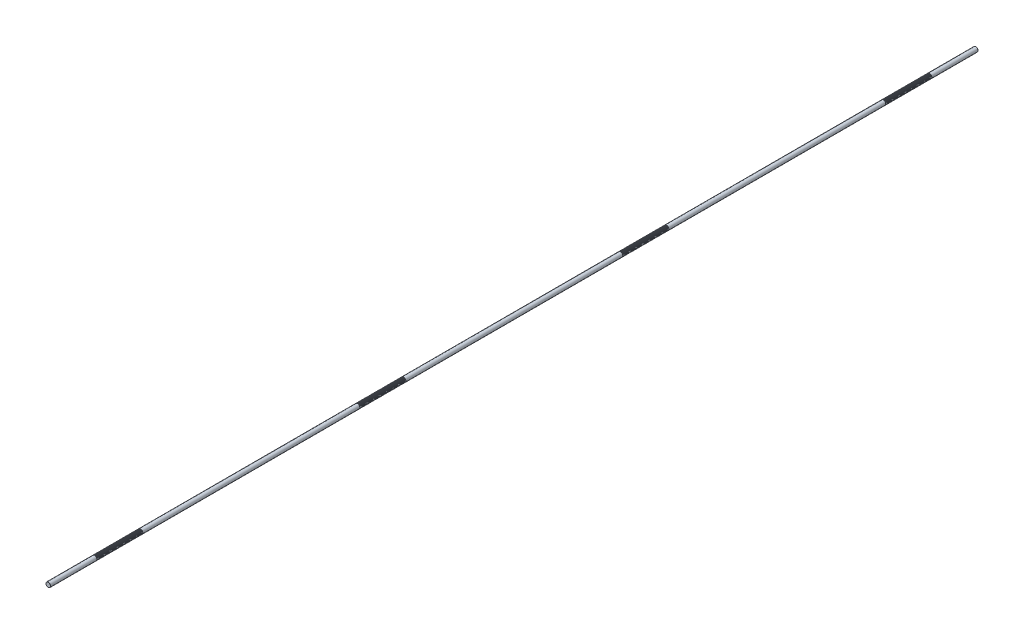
from build123d import *

# Parameters (mm, degrees)
SKETCH1_R           = 5
BOSS_EXTRUDE1_DEPTH = 1000
CHAMFER1_SIZE       = 0.25
LPATTERN1_COUNT     = 50
LPATTERN1_PITCH     = 2
LPATTERN2_COUNT     = 4
LPATTERN2_PITCH     = 567


with BuildPart() as part:
    # Sketch1 → Boss-Extrude1 (new, symmetric)
    with BuildSketch(Plane.XY):
        Circle(SKETCH1_R)
    extrude(amount=BOSS_EXTRUDE1_DEPTH, both=True)

    # Chamfer1
    chamfer1_edges = [part.edges().sort_by_distance(p)[0] for p in [
        (-5, 0, -1000),
        (-5, 0, 1000),
    ]]
    chamfer(chamfer1_edges, length=CHAMFER1_SIZE)

    # Sketch2 → Cut-Revolve1 (revolve, cut)
    with BuildSketch(Plane(origin=(0, 0, 0), x_dir=(0, 0, -1), z_dir=(1, 0, 0)), mode=Mode.PRIVATE) as cut_revolve1_sk:
        Polygon((900.167468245, 5), (898.832531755, 5), (899.167468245, 3.75), (899.832531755, 3.75), align=None)
    cut_revolve1 = revolve(cut_revolve1_sk.sketch.rotate(Axis((0, 0, 1000), (0, 0, -1)), 90), axis=Axis((0, 0, 1000), (0, 0, -1)), mode=Mode.SUBTRACT)

    # LPattern1: Cut-Revolve1 ×50
    with Locations(*[(0, 0, i * LPATTERN1_PITCH) for i in range(1, LPATTERN1_COUNT)]):
        add(cut_revolve1, mode=Mode.SUBTRACT)

    # LPattern2: Cut-Revolve1 ×4
    with Locations(*[(0, 0, i * LPATTERN2_PITCH) for i in range(1, LPATTERN2_COUNT)]):
        add(cut_revolve1, mode=Mode.SUBTRACT)

    # LPattern2 copy 1 sketch → LPattern2 copy 1 (revolve, cut)
    with BuildSketch(Plane(origin=(0, 0, 569), x_dir=(0, 0, -1), z_dir=(1, 0, 0))):
        Polygon((900.167468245, 5), (898.832531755, 5), (899.167468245, 3.75), (899.832531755, 3.75), align=None)
    revolve(axis=Axis((0, 0, 1569), (0, 0, -1)), mode=Mode.SUBTRACT)

    # LPattern2 copy 2 sketch → LPattern2 copy 2 (revolve, cut)
    with BuildSketch(Plane(origin=(0, 0, 1136), x_dir=(0, 0, -1), z_dir=(1, 0, 0))):
        Polygon((900.167468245, 5), (898.832531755, 5), (899.167468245, 3.75), (899.832531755, 3.75), align=None)
    revolve(axis=Axis((0, 0, 2136), (0, 0, -1)), mode=Mode.SUBTRACT)

    # LPattern2 copy 3 sketch → LPattern2 copy 3 (revolve, cut)
    with BuildSketch(Plane(origin=(0, 0, 1703), x_dir=(0, 0, -1), z_dir=(1, 0, 0))):
        Polygon((900.167468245, 5), (898.832531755, 5), (899.167468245, 3.75), (899.832531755, 3.75), align=None)
    revolve(axis=Axis((0, 0, 2703), (0, 0, -1)), mode=Mode.SUBTRACT)

    # LPattern2 copy 4 sketch → LPattern2 copy 4 (revolve, cut)
    with BuildSketch(Plane(origin=(0, 0, 571), x_dir=(0, 0, -1), z_dir=(1, 0, 0))):
        Polygon((900.167468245, 5), (898.832531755, 5), (899.167468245, 3.75), (899.832531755, 3.75), align=None)
    revolve(axis=Axis((0, 0, 1571), (0, 0, -1)), mode=Mode.SUBTRACT)

    # LPattern2 copy 5 sketch → LPattern2 copy 5 (revolve, cut)
    with BuildSketch(Plane(origin=(0, 0, 1138), x_dir=(0, 0, -1), z_dir=(1, 0, 0))):
        Polygon((900.167468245, 5), (898.832531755, 5), (899.167468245, 3.75), (899.832531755, 3.75), align=None)
    revolve(axis=Axis((0, 0, 2138), (0, 0, -1)), mode=Mode.SUBTRACT)

    # LPattern2 copy 6 sketch → LPattern2 copy 6 (revolve, cut)
    with BuildSketch(Plane(origin=(0, 0, 1705), x_dir=(0, 0, -1), z_dir=(1, 0, 0))):
        Polygon((900.167468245, 5), (898.832531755, 5), (899.167468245, 3.75), (899.832531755, 3.75), align=None)
    revolve(axis=Axis((0, 0, 2705), (0, 0, -1)), mode=Mode.SUBTRACT)

    # LPattern2 copy 7 sketch → LPattern2 copy 7 (revolve, cut)
    with BuildSketch(Plane(origin=(0, 0, 573), x_dir=(0, 0, -1), z_dir=(1, 0, 0))):
        Polygon((900.167468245, 5), (898.832531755, 5), (899.167468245, 3.75), (899.832531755, 3.75), align=None)
    revolve(axis=Axis((0, 0, 1573), (0, 0, -1)), mode=Mode.SUBTRACT)

    # LPattern2 copy 8 sketch → LPattern2 copy 8 (revolve, cut)
    with BuildSketch(Plane(origin=(0, 0, 1140), x_dir=(0, 0, -1), z_dir=(1, 0, 0))):
        Polygon((900.167468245, 5), (898.832531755, 5), (899.167468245, 3.75), (899.832531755, 3.75), align=None)
    revolve(axis=Axis((0, 0, 2140), (0, 0, -1)), mode=Mode.SUBTRACT)

    # LPattern2 copy 9 sketch → LPattern2 copy 9 (revolve, cut)
    with BuildSketch(Plane(origin=(0, 0, 1707), x_dir=(0, 0, -1), z_dir=(1, 0, 0))):
        Polygon((900.167468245, 5), (898.832531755, 5), (899.167468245, 3.75), (899.832531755, 3.75), align=None)
    revolve(axis=Axis((0, 0, 2707), (0, 0, -1)), mode=Mode.SUBTRACT)

    # LPattern2 copy 10 sketch → LPattern2 copy 10 (revolve, cut)
    with BuildSketch(Plane(origin=(0, 0, 575), x_dir=(0, 0, -1), z_dir=(1, 0, 0))):
        Polygon((900.167468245, 5), (898.832531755, 5), (899.167468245, 3.75), (899.832531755, 3.75), align=None)
    revolve(axis=Axis((0, 0, 1575), (0, 0, -1)), mode=Mode.SUBTRACT)

    # LPattern2 copy 11 sketch → LPattern2 copy 11 (revolve, cut)
    with BuildSketch(Plane(origin=(0, 0, 1142), x_dir=(0, 0, -1), z_dir=(1, 0, 0))):
        Polygon((900.167468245, 5), (898.832531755, 5), (899.167468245, 3.75), (899.832531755, 3.75), align=None)
    revolve(axis=Axis((0, 0, 2142), (0, 0, -1)), mode=Mode.SUBTRACT)

    # LPattern2 copy 12 sketch → LPattern2 copy 12 (revolve, cut)
    with BuildSketch(Plane(origin=(0, 0, 1709), x_dir=(0, 0, -1), z_dir=(1, 0, 0))):
        Polygon((900.167468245, 5), (898.832531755, 5), (899.167468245, 3.75), (899.832531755, 3.75), align=None)
    revolve(axis=Axis((0, 0, 2709), (0, 0, -1)), mode=Mode.SUBTRACT)

    # LPattern2 copy 13 sketch → LPattern2 copy 13 (revolve, cut)
    with BuildSketch(Plane(origin=(0, 0, 577), x_dir=(0, 0, -1), z_dir=(1, 0, 0))):
        Polygon((900.167468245, 5), (898.832531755, 5), (899.167468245, 3.75), (899.832531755, 3.75), align=None)
    revolve(axis=Axis((0, 0, 1577), (0, 0, -1)), mode=Mode.SUBTRACT)

    # LPattern2 copy 14 sketch → LPattern2 copy 14 (revolve, cut)
    with BuildSketch(Plane(origin=(0, 0, 1144), x_dir=(0, 0, -1), z_dir=(1, 0, 0))):
        Polygon((900.167468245, 5), (898.832531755, 5), (899.167468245, 3.75), (899.832531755, 3.75), align=None)
    revolve(axis=Axis((0, 0, 2144), (0, 0, -1)), mode=Mode.SUBTRACT)

    # LPattern2 copy 15 sketch → LPattern2 copy 15 (revolve, cut)
    with BuildSketch(Plane(origin=(0, 0, 1711), x_dir=(0, 0, -1), z_dir=(1, 0, 0))):
        Polygon((900.167468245, 5), (898.832531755, 5), (899.167468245, 3.75), (899.832531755, 3.75), align=None)
    revolve(axis=Axis((0, 0, 2711), (0, 0, -1)), mode=Mode.SUBTRACT)

    # LPattern2 copy 16 sketch → LPattern2 copy 16 (revolve, cut)
    with BuildSketch(Plane(origin=(0, 0, 579), x_dir=(0, 0, -1), z_dir=(1, 0, 0))):
        Polygon((900.167468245, 5), (898.832531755, 5), (899.167468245, 3.75), (899.832531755, 3.75), align=None)
    revolve(axis=Axis((0, 0, 1579), (0, 0, -1)), mode=Mode.SUBTRACT)

    # LPattern2 copy 17 sketch → LPattern2 copy 17 (revolve, cut)
    with BuildSketch(Plane(origin=(0, 0, 1146), x_dir=(0, 0, -1), z_dir=(1, 0, 0))):
        Polygon((900.167468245, 5), (898.832531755, 5), (899.167468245, 3.75), (899.832531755, 3.75), align=None)
    revolve(axis=Axis((0, 0, 2146), (0, 0, -1)), mode=Mode.SUBTRACT)

    # LPattern2 copy 18 sketch → LPattern2 copy 18 (revolve, cut)
    with BuildSketch(Plane(origin=(0, 0, 1713), x_dir=(0, 0, -1), z_dir=(1, 0, 0))):
        Polygon((900.167468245, 5), (898.832531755, 5), (899.167468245, 3.75), (899.832531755, 3.75), align=None)
    revolve(axis=Axis((0, 0, 2713), (0, 0, -1)), mode=Mode.SUBTRACT)

    # LPattern2 copy 19 sketch → LPattern2 copy 19 (revolve, cut)
    with BuildSketch(Plane(origin=(0, 0, 581), x_dir=(0, 0, -1), z_dir=(1, 0, 0))):
        Polygon((900.167468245, 5), (898.832531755, 5), (899.167468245, 3.75), (899.832531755, 3.75), align=None)
    revolve(axis=Axis((0, 0, 1581), (0, 0, -1)), mode=Mode.SUBTRACT)

    # LPattern2 copy 20 sketch → LPattern2 copy 20 (revolve, cut)
    with BuildSketch(Plane(origin=(0, 0, 1148), x_dir=(0, 0, -1), z_dir=(1, 0, 0))):
        Polygon((900.167468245, 5), (898.832531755, 5), (899.167468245, 3.75), (899.832531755, 3.75), align=None)
    revolve(axis=Axis((0, 0, 2148), (0, 0, -1)), mode=Mode.SUBTRACT)

    # LPattern2 copy 21 sketch → LPattern2 copy 21 (revolve, cut)
    with BuildSketch(Plane(origin=(0, 0, 1715), x_dir=(0, 0, -1), z_dir=(1, 0, 0))):
        Polygon((900.167468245, 5), (898.832531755, 5), (899.167468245, 3.75), (899.832531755, 3.75), align=None)
    revolve(axis=Axis((0, 0, 2715), (0, 0, -1)), mode=Mode.SUBTRACT)

    # LPattern2 copy 22 sketch → LPattern2 copy 22 (revolve, cut)
    with BuildSketch(Plane(origin=(0, 0, 583), x_dir=(0, 0, -1), z_dir=(1, 0, 0))):
        Polygon((900.167468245, 5), (898.832531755, 5), (899.167468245, 3.75), (899.832531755, 3.75), align=None)
    revolve(axis=Axis((0, 0, 1583), (0, 0, -1)), mode=Mode.SUBTRACT)

    # LPattern2 copy 23 sketch → LPattern2 copy 23 (revolve, cut)
    with BuildSketch(Plane(origin=(0, 0, 1150), x_dir=(0, 0, -1), z_dir=(1, 0, 0))):
        Polygon((900.167468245, 5), (898.832531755, 5), (899.167468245, 3.75), (899.832531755, 3.75), align=None)
    revolve(axis=Axis((0, 0, 2150), (0, 0, -1)), mode=Mode.SUBTRACT)

    # LPattern2 copy 24 sketch → LPattern2 copy 24 (revolve, cut)
    with BuildSketch(Plane(origin=(0, 0, 1717), x_dir=(0, 0, -1), z_dir=(1, 0, 0))):
        Polygon((900.167468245, 5), (898.832531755, 5), (899.167468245, 3.75), (899.832531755, 3.75), align=None)
    revolve(axis=Axis((0, 0, 2717), (0, 0, -1)), mode=Mode.SUBTRACT)

    # LPattern2 copy 25 sketch → LPattern2 copy 25 (revolve, cut)
    with BuildSketch(Plane(origin=(0, 0, 585), x_dir=(0, 0, -1), z_dir=(1, 0, 0))):
        Polygon((900.167468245, 5), (898.832531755, 5), (899.167468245, 3.75), (899.832531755, 3.75), align=None)
    revolve(axis=Axis((0, 0, 1585), (0, 0, -1)), mode=Mode.SUBTRACT)

    # LPattern2 copy 26 sketch → LPattern2 copy 26 (revolve, cut)
    with BuildSketch(Plane(origin=(0, 0, 1152), x_dir=(0, 0, -1), z_dir=(1, 0, 0))):
        Polygon((900.167468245, 5), (898.832531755, 5), (899.167468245, 3.75), (899.832531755, 3.75), align=None)
    revolve(axis=Axis((0, 0, 2152), (0, 0, -1)), mode=Mode.SUBTRACT)

    # LPattern2 copy 27 sketch → LPattern2 copy 27 (revolve, cut)
    with BuildSketch(Plane(origin=(0, 0, 1719), x_dir=(0, 0, -1), z_dir=(1, 0, 0))):
        Polygon((900.167468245, 5), (898.832531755, 5), (899.167468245, 3.75), (899.832531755, 3.75), align=None)
    revolve(axis=Axis((0, 0, 2719), (0, 0, -1)), mode=Mode.SUBTRACT)

    # LPattern2 copy 28 sketch → LPattern2 copy 28 (revolve, cut)
    with BuildSketch(Plane(origin=(0, 0, 587), x_dir=(0, 0, -1), z_dir=(1, 0, 0))):
        Polygon((900.167468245, 5), (898.832531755, 5), (899.167468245, 3.75), (899.832531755, 3.75), align=None)
    revolve(axis=Axis((0, 0, 1587), (0, 0, -1)), mode=Mode.SUBTRACT)

    # LPattern2 copy 29 sketch → LPattern2 copy 29 (revolve, cut)
    with BuildSketch(Plane(origin=(0, 0, 1154), x_dir=(0, 0, -1), z_dir=(1, 0, 0))):
        Polygon((900.167468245, 5), (898.832531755, 5), (899.167468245, 3.75), (899.832531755, 3.75), align=None)
    revolve(axis=Axis((0, 0, 2154), (0, 0, -1)), mode=Mode.SUBTRACT)

    # LPattern2 copy 30 sketch → LPattern2 copy 30 (revolve, cut)
    with BuildSketch(Plane(origin=(0, 0, 1721), x_dir=(0, 0, -1), z_dir=(1, 0, 0))):
        Polygon((900.167468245, 5), (898.832531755, 5), (899.167468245, 3.75), (899.832531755, 3.75), align=None)
    revolve(axis=Axis((0, 0, 2721), (0, 0, -1)), mode=Mode.SUBTRACT)

    # LPattern2 copy 31 sketch → LPattern2 copy 31 (revolve, cut)
    with BuildSketch(Plane(origin=(0, 0, 589), x_dir=(0, 0, -1), z_dir=(1, 0, 0))):
        Polygon((900.167468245, 5), (898.832531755, 5), (899.167468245, 3.75), (899.832531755, 3.75), align=None)
    revolve(axis=Axis((0, 0, 1589), (0, 0, -1)), mode=Mode.SUBTRACT)

    # LPattern2 copy 32 sketch → LPattern2 copy 32 (revolve, cut)
    with BuildSketch(Plane(origin=(0, 0, 1156), x_dir=(0, 0, -1), z_dir=(1, 0, 0))):
        Polygon((900.167468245, 5), (898.832531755, 5), (899.167468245, 3.75), (899.832531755, 3.75), align=None)
    revolve(axis=Axis((0, 0, 2156), (0, 0, -1)), mode=Mode.SUBTRACT)

    # LPattern2 copy 33 sketch → LPattern2 copy 33 (revolve, cut)
    with BuildSketch(Plane(origin=(0, 0, 1723), x_dir=(0, 0, -1), z_dir=(1, 0, 0))):
        Polygon((900.167468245, 5), (898.832531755, 5), (899.167468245, 3.75), (899.832531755, 3.75), align=None)
    revolve(axis=Axis((0, 0, 2723), (0, 0, -1)), mode=Mode.SUBTRACT)

    # LPattern2 copy 34 sketch → LPattern2 copy 34 (revolve, cut)
    with BuildSketch(Plane(origin=(0, 0, 591), x_dir=(0, 0, -1), z_dir=(1, 0, 0))):
        Polygon((900.167468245, 5), (898.832531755, 5), (899.167468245, 3.75), (899.832531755, 3.75), align=None)
    revolve(axis=Axis((0, 0, 1591), (0, 0, -1)), mode=Mode.SUBTRACT)

    # LPattern2 copy 35 sketch → LPattern2 copy 35 (revolve, cut)
    with BuildSketch(Plane(origin=(0, 0, 1158), x_dir=(0, 0, -1), z_dir=(1, 0, 0))):
        Polygon((900.167468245, 5), (898.832531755, 5), (899.167468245, 3.75), (899.832531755, 3.75), align=None)
    revolve(axis=Axis((0, 0, 2158), (0, 0, -1)), mode=Mode.SUBTRACT)

    # LPattern2 copy 36 sketch → LPattern2 copy 36 (revolve, cut)
    with BuildSketch(Plane(origin=(0, 0, 1725), x_dir=(0, 0, -1), z_dir=(1, 0, 0))):
        Polygon((900.167468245, 5), (898.832531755, 5), (899.167468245, 3.75), (899.832531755, 3.75), align=None)
    revolve(axis=Axis((0, 0, 2725), (0, 0, -1)), mode=Mode.SUBTRACT)

    # LPattern2 copy 37 sketch → LPattern2 copy 37 (revolve, cut)
    with BuildSketch(Plane(origin=(0, 0, 593), x_dir=(0, 0, -1), z_dir=(1, 0, 0))):
        Polygon((900.167468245, 5), (898.832531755, 5), (899.167468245, 3.75), (899.832531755, 3.75), align=None)
    revolve(axis=Axis((0, 0, 1593), (0, 0, -1)), mode=Mode.SUBTRACT)

    # LPattern2 copy 38 sketch → LPattern2 copy 38 (revolve, cut)
    with BuildSketch(Plane(origin=(0, 0, 1160), x_dir=(0, 0, -1), z_dir=(1, 0, 0))):
        Polygon((900.167468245, 5), (898.832531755, 5), (899.167468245, 3.75), (899.832531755, 3.75), align=None)
    revolve(axis=Axis((0, 0, 2160), (0, 0, -1)), mode=Mode.SUBTRACT)

    # LPattern2 copy 39 sketch → LPattern2 copy 39 (revolve, cut)
    with BuildSketch(Plane(origin=(0, 0, 1727), x_dir=(0, 0, -1), z_dir=(1, 0, 0))):
        Polygon((900.167468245, 5), (898.832531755, 5), (899.167468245, 3.75), (899.832531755, 3.75), align=None)
    revolve(axis=Axis((0, 0, 2727), (0, 0, -1)), mode=Mode.SUBTRACT)

    # LPattern2 copy 40 sketch → LPattern2 copy 40 (revolve, cut)
    with BuildSketch(Plane(origin=(0, 0, 595), x_dir=(0, 0, -1), z_dir=(1, 0, 0))):
        Polygon((900.167468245, 5), (898.832531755, 5), (899.167468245, 3.75), (899.832531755, 3.75), align=None)
    revolve(axis=Axis((0, 0, 1595), (0, 0, -1)), mode=Mode.SUBTRACT)

    # LPattern2 copy 41 sketch → LPattern2 copy 41 (revolve, cut)
    with BuildSketch(Plane(origin=(0, 0, 1162), x_dir=(0, 0, -1), z_dir=(1, 0, 0))):
        Polygon((900.167468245, 5), (898.832531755, 5), (899.167468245, 3.75), (899.832531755, 3.75), align=None)
    revolve(axis=Axis((0, 0, 2162), (0, 0, -1)), mode=Mode.SUBTRACT)

    # LPattern2 copy 42 sketch → LPattern2 copy 42 (revolve, cut)
    with BuildSketch(Plane(origin=(0, 0, 1729), x_dir=(0, 0, -1), z_dir=(1, 0, 0))):
        Polygon((900.167468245, 5), (898.832531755, 5), (899.167468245, 3.75), (899.832531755, 3.75), align=None)
    revolve(axis=Axis((0, 0, 2729), (0, 0, -1)), mode=Mode.SUBTRACT)

    # LPattern2 copy 43 sketch → LPattern2 copy 43 (revolve, cut)
    with BuildSketch(Plane(origin=(0, 0, 597), x_dir=(0, 0, -1), z_dir=(1, 0, 0))):
        Polygon((900.167468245, 5), (898.832531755, 5), (899.167468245, 3.75), (899.832531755, 3.75), align=None)
    revolve(axis=Axis((0, 0, 1597), (0, 0, -1)), mode=Mode.SUBTRACT)

    # LPattern2 copy 44 sketch → LPattern2 copy 44 (revolve, cut)
    with BuildSketch(Plane(origin=(0, 0, 1164), x_dir=(0, 0, -1), z_dir=(1, 0, 0))):
        Polygon((900.167468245, 5), (898.832531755, 5), (899.167468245, 3.75), (899.832531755, 3.75), align=None)
    revolve(axis=Axis((0, 0, 2164), (0, 0, -1)), mode=Mode.SUBTRACT)

    # LPattern2 copy 45 sketch → LPattern2 copy 45 (revolve, cut)
    with BuildSketch(Plane(origin=(0, 0, 1731), x_dir=(0, 0, -1), z_dir=(1, 0, 0))):
        Polygon((900.167468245, 5), (898.832531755, 5), (899.167468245, 3.75), (899.832531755, 3.75), align=None)
    revolve(axis=Axis((0, 0, 2731), (0, 0, -1)), mode=Mode.SUBTRACT)

    # LPattern2 copy 46 sketch → LPattern2 copy 46 (revolve, cut)
    with BuildSketch(Plane(origin=(0, 0, 599), x_dir=(0, 0, -1), z_dir=(1, 0, 0))):
        Polygon((900.167468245, 5), (898.832531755, 5), (899.167468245, 3.75), (899.832531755, 3.75), align=None)
    revolve(axis=Axis((0, 0, 1599), (0, 0, -1)), mode=Mode.SUBTRACT)

    # LPattern2 copy 47 sketch → LPattern2 copy 47 (revolve, cut)
    with BuildSketch(Plane(origin=(0, 0, 1166), x_dir=(0, 0, -1), z_dir=(1, 0, 0))):
        Polygon((900.167468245, 5), (898.832531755, 5), (899.167468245, 3.75), (899.832531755, 3.75), align=None)
    revolve(axis=Axis((0, 0, 2166), (0, 0, -1)), mode=Mode.SUBTRACT)

    # LPattern2 copy 48 sketch → LPattern2 copy 48 (revolve, cut)
    with BuildSketch(Plane(origin=(0, 0, 1733), x_dir=(0, 0, -1), z_dir=(1, 0, 0))):
        Polygon((900.167468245, 5), (898.832531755, 5), (899.167468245, 3.75), (899.832531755, 3.75), align=None)
    revolve(axis=Axis((0, 0, 2733), (0, 0, -1)), mode=Mode.SUBTRACT)

    # LPattern2 copy 49 sketch → LPattern2 copy 49 (revolve, cut)
    with BuildSketch(Plane(origin=(0, 0, 601), x_dir=(0, 0, -1), z_dir=(1, 0, 0))):
        Polygon((900.167468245, 5), (898.832531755, 5), (899.167468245, 3.75), (899.832531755, 3.75), align=None)
    revolve(axis=Axis((0, 0, 1601), (0, 0, -1)), mode=Mode.SUBTRACT)

    # LPattern2 copy 50 sketch → LPattern2 copy 50 (revolve, cut)
    with BuildSketch(Plane(origin=(0, 0, 1168), x_dir=(0, 0, -1), z_dir=(1, 0, 0))):
        Polygon((900.167468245, 5), (898.832531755, 5), (899.167468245, 3.75), (899.832531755, 3.75), align=None)
    revolve(axis=Axis((0, 0, 2168), (0, 0, -1)), mode=Mode.SUBTRACT)

    # LPattern2 copy 51 sketch → LPattern2 copy 51 (revolve, cut)
    with BuildSketch(Plane(origin=(0, 0, 1735), x_dir=(0, 0, -1), z_dir=(1, 0, 0))):
        Polygon((900.167468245, 5), (898.832531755, 5), (899.167468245, 3.75), (899.832531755, 3.75), align=None)
    revolve(axis=Axis((0, 0, 2735), (0, 0, -1)), mode=Mode.SUBTRACT)

    # LPattern2 copy 52 sketch → LPattern2 copy 52 (revolve, cut)
    with BuildSketch(Plane(origin=(0, 0, 603), x_dir=(0, 0, -1), z_dir=(1, 0, 0))):
        Polygon((900.167468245, 5), (898.832531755, 5), (899.167468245, 3.75), (899.832531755, 3.75), align=None)
    revolve(axis=Axis((0, 0, 1603), (0, 0, -1)), mode=Mode.SUBTRACT)

    # LPattern2 copy 53 sketch → LPattern2 copy 53 (revolve, cut)
    with BuildSketch(Plane(origin=(0, 0, 1170), x_dir=(0, 0, -1), z_dir=(1, 0, 0))):
        Polygon((900.167468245, 5), (898.832531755, 5), (899.167468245, 3.75), (899.832531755, 3.75), align=None)
    revolve(axis=Axis((0, 0, 2170), (0, 0, -1)), mode=Mode.SUBTRACT)

    # LPattern2 copy 54 sketch → LPattern2 copy 54 (revolve, cut)
    with BuildSketch(Plane(origin=(0, 0, 1737), x_dir=(0, 0, -1), z_dir=(1, 0, 0))):
        Polygon((900.167468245, 5), (898.832531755, 5), (899.167468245, 3.75), (899.832531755, 3.75), align=None)
    revolve(axis=Axis((0, 0, 2737), (0, 0, -1)), mode=Mode.SUBTRACT)

    # LPattern2 copy 55 sketch → LPattern2 copy 55 (revolve, cut)
    with BuildSketch(Plane(origin=(0, 0, 605), x_dir=(0, 0, -1), z_dir=(1, 0, 0))):
        Polygon((900.167468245, 5), (898.832531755, 5), (899.167468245, 3.75), (899.832531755, 3.75), align=None)
    revolve(axis=Axis((0, 0, 1605), (0, 0, -1)), mode=Mode.SUBTRACT)

    # LPattern2 copy 56 sketch → LPattern2 copy 56 (revolve, cut)
    with BuildSketch(Plane(origin=(0, 0, 1172), x_dir=(0, 0, -1), z_dir=(1, 0, 0))):
        Polygon((900.167468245, 5), (898.832531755, 5), (899.167468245, 3.75), (899.832531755, 3.75), align=None)
    revolve(axis=Axis((0, 0, 2172), (0, 0, -1)), mode=Mode.SUBTRACT)

    # LPattern2 copy 57 sketch → LPattern2 copy 57 (revolve, cut)
    with BuildSketch(Plane(origin=(0, 0, 1739), x_dir=(0, 0, -1), z_dir=(1, 0, 0))):
        Polygon((900.167468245, 5), (898.832531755, 5), (899.167468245, 3.75), (899.832531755, 3.75), align=None)
    revolve(axis=Axis((0, 0, 2739), (0, 0, -1)), mode=Mode.SUBTRACT)

    # LPattern2 copy 58 sketch → LPattern2 copy 58 (revolve, cut)
    with BuildSketch(Plane(origin=(0, 0, 607), x_dir=(0, 0, -1), z_dir=(1, 0, 0))):
        Polygon((900.167468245, 5), (898.832531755, 5), (899.167468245, 3.75), (899.832531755, 3.75), align=None)
    revolve(axis=Axis((0, 0, 1607), (0, 0, -1)), mode=Mode.SUBTRACT)

    # LPattern2 copy 59 sketch → LPattern2 copy 59 (revolve, cut)
    with BuildSketch(Plane(origin=(0, 0, 1174), x_dir=(0, 0, -1), z_dir=(1, 0, 0))):
        Polygon((900.167468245, 5), (898.832531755, 5), (899.167468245, 3.75), (899.832531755, 3.75), align=None)
    revolve(axis=Axis((0, 0, 2174), (0, 0, -1)), mode=Mode.SUBTRACT)

    # LPattern2 copy 60 sketch → LPattern2 copy 60 (revolve, cut)
    with BuildSketch(Plane(origin=(0, 0, 1741), x_dir=(0, 0, -1), z_dir=(1, 0, 0))):
        Polygon((900.167468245, 5), (898.832531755, 5), (899.167468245, 3.75), (899.832531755, 3.75), align=None)
    revolve(axis=Axis((0, 0, 2741), (0, 0, -1)), mode=Mode.SUBTRACT)

    # LPattern2 copy 61 sketch → LPattern2 copy 61 (revolve, cut)
    with BuildSketch(Plane(origin=(0, 0, 609), x_dir=(0, 0, -1), z_dir=(1, 0, 0))):
        Polygon((900.167468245, 5), (898.832531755, 5), (899.167468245, 3.75), (899.832531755, 3.75), align=None)
    revolve(axis=Axis((0, 0, 1609), (0, 0, -1)), mode=Mode.SUBTRACT)

    # LPattern2 copy 62 sketch → LPattern2 copy 62 (revolve, cut)
    with BuildSketch(Plane(origin=(0, 0, 1176), x_dir=(0, 0, -1), z_dir=(1, 0, 0))):
        Polygon((900.167468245, 5), (898.832531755, 5), (899.167468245, 3.75), (899.832531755, 3.75), align=None)
    revolve(axis=Axis((0, 0, 2176), (0, 0, -1)), mode=Mode.SUBTRACT)

    # LPattern2 copy 63 sketch → LPattern2 copy 63 (revolve, cut)
    with BuildSketch(Plane(origin=(0, 0, 1743), x_dir=(0, 0, -1), z_dir=(1, 0, 0))):
        Polygon((900.167468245, 5), (898.832531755, 5), (899.167468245, 3.75), (899.832531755, 3.75), align=None)
    revolve(axis=Axis((0, 0, 2743), (0, 0, -1)), mode=Mode.SUBTRACT)

    # LPattern2 copy 64 sketch → LPattern2 copy 64 (revolve, cut)
    with BuildSketch(Plane(origin=(0, 0, 611), x_dir=(0, 0, -1), z_dir=(1, 0, 0))):
        Polygon((900.167468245, 5), (898.832531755, 5), (899.167468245, 3.75), (899.832531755, 3.75), align=None)
    revolve(axis=Axis((0, 0, 1611), (0, 0, -1)), mode=Mode.SUBTRACT)

    # LPattern2 copy 65 sketch → LPattern2 copy 65 (revolve, cut)
    with BuildSketch(Plane(origin=(0, 0, 1178), x_dir=(0, 0, -1), z_dir=(1, 0, 0))):
        Polygon((900.167468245, 5), (898.832531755, 5), (899.167468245, 3.75), (899.832531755, 3.75), align=None)
    revolve(axis=Axis((0, 0, 2178), (0, 0, -1)), mode=Mode.SUBTRACT)

    # LPattern2 copy 66 sketch → LPattern2 copy 66 (revolve, cut)
    with BuildSketch(Plane(origin=(0, 0, 1745), x_dir=(0, 0, -1), z_dir=(1, 0, 0))):
        Polygon((900.167468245, 5), (898.832531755, 5), (899.167468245, 3.75), (899.832531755, 3.75), align=None)
    revolve(axis=Axis((0, 0, 2745), (0, 0, -1)), mode=Mode.SUBTRACT)

    # LPattern2 copy 67 sketch → LPattern2 copy 67 (revolve, cut)
    with BuildSketch(Plane(origin=(0, 0, 613), x_dir=(0, 0, -1), z_dir=(1, 0, 0))):
        Polygon((900.167468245, 5), (898.832531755, 5), (899.167468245, 3.75), (899.832531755, 3.75), align=None)
    revolve(axis=Axis((0, 0, 1613), (0, 0, -1)), mode=Mode.SUBTRACT)

    # LPattern2 copy 68 sketch → LPattern2 copy 68 (revolve, cut)
    with BuildSketch(Plane(origin=(0, 0, 1180), x_dir=(0, 0, -1), z_dir=(1, 0, 0))):
        Polygon((900.167468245, 5), (898.832531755, 5), (899.167468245, 3.75), (899.832531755, 3.75), align=None)
    revolve(axis=Axis((0, 0, 2180), (0, 0, -1)), mode=Mode.SUBTRACT)

    # LPattern2 copy 69 sketch → LPattern2 copy 69 (revolve, cut)
    with BuildSketch(Plane(origin=(0, 0, 1747), x_dir=(0, 0, -1), z_dir=(1, 0, 0))):
        Polygon((900.167468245, 5), (898.832531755, 5), (899.167468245, 3.75), (899.832531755, 3.75), align=None)
    revolve(axis=Axis((0, 0, 2747), (0, 0, -1)), mode=Mode.SUBTRACT)

    # LPattern2 copy 70 sketch → LPattern2 copy 70 (revolve, cut)
    with BuildSketch(Plane(origin=(0, 0, 615), x_dir=(0, 0, -1), z_dir=(1, 0, 0))):
        Polygon((900.167468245, 5), (898.832531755, 5), (899.167468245, 3.75), (899.832531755, 3.75), align=None)
    revolve(axis=Axis((0, 0, 1615), (0, 0, -1)), mode=Mode.SUBTRACT)

    # LPattern2 copy 71 sketch → LPattern2 copy 71 (revolve, cut)
    with BuildSketch(Plane(origin=(0, 0, 1182), x_dir=(0, 0, -1), z_dir=(1, 0, 0))):
        Polygon((900.167468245, 5), (898.832531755, 5), (899.167468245, 3.75), (899.832531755, 3.75), align=None)
    revolve(axis=Axis((0, 0, 2182), (0, 0, -1)), mode=Mode.SUBTRACT)

    # LPattern2 copy 72 sketch → LPattern2 copy 72 (revolve, cut)
    with BuildSketch(Plane(origin=(0, 0, 1749), x_dir=(0, 0, -1), z_dir=(1, 0, 0))):
        Polygon((900.167468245, 5), (898.832531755, 5), (899.167468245, 3.75), (899.832531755, 3.75), align=None)
    revolve(axis=Axis((0, 0, 2749), (0, 0, -1)), mode=Mode.SUBTRACT)

    # LPattern2 copy 73 sketch → LPattern2 copy 73 (revolve, cut)
    with BuildSketch(Plane(origin=(0, 0, 617), x_dir=(0, 0, -1), z_dir=(1, 0, 0))):
        Polygon((900.167468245, 5), (898.832531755, 5), (899.167468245, 3.75), (899.832531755, 3.75), align=None)
    revolve(axis=Axis((0, 0, 1617), (0, 0, -1)), mode=Mode.SUBTRACT)

    # LPattern2 copy 74 sketch → LPattern2 copy 74 (revolve, cut)
    with BuildSketch(Plane(origin=(0, 0, 1184), x_dir=(0, 0, -1), z_dir=(1, 0, 0))):
        Polygon((900.167468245, 5), (898.832531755, 5), (899.167468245, 3.75), (899.832531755, 3.75), align=None)
    revolve(axis=Axis((0, 0, 2184), (0, 0, -1)), mode=Mode.SUBTRACT)

    # LPattern2 copy 75 sketch → LPattern2 copy 75 (revolve, cut)
    with BuildSketch(Plane(origin=(0, 0, 1751), x_dir=(0, 0, -1), z_dir=(1, 0, 0))):
        Polygon((900.167468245, 5), (898.832531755, 5), (899.167468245, 3.75), (899.832531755, 3.75), align=None)
    revolve(axis=Axis((0, 0, 2751), (0, 0, -1)), mode=Mode.SUBTRACT)

    # LPattern2 copy 76 sketch → LPattern2 copy 76 (revolve, cut)
    with BuildSketch(Plane(origin=(0, 0, 619), x_dir=(0, 0, -1), z_dir=(1, 0, 0))):
        Polygon((900.167468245, 5), (898.832531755, 5), (899.167468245, 3.75), (899.832531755, 3.75), align=None)
    revolve(axis=Axis((0, 0, 1619), (0, 0, -1)), mode=Mode.SUBTRACT)

    # LPattern2 copy 77 sketch → LPattern2 copy 77 (revolve, cut)
    with BuildSketch(Plane(origin=(0, 0, 1186), x_dir=(0, 0, -1), z_dir=(1, 0, 0))):
        Polygon((900.167468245, 5), (898.832531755, 5), (899.167468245, 3.75), (899.832531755, 3.75), align=None)
    revolve(axis=Axis((0, 0, 2186), (0, 0, -1)), mode=Mode.SUBTRACT)

    # LPattern2 copy 78 sketch → LPattern2 copy 78 (revolve, cut)
    with BuildSketch(Plane(origin=(0, 0, 1753), x_dir=(0, 0, -1), z_dir=(1, 0, 0))):
        Polygon((900.167468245, 5), (898.832531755, 5), (899.167468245, 3.75), (899.832531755, 3.75), align=None)
    revolve(axis=Axis((0, 0, 2753), (0, 0, -1)), mode=Mode.SUBTRACT)

    # LPattern2 copy 79 sketch → LPattern2 copy 79 (revolve, cut)
    with BuildSketch(Plane(origin=(0, 0, 621), x_dir=(0, 0, -1), z_dir=(1, 0, 0))):
        Polygon((900.167468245, 5), (898.832531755, 5), (899.167468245, 3.75), (899.832531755, 3.75), align=None)
    revolve(axis=Axis((0, 0, 1621), (0, 0, -1)), mode=Mode.SUBTRACT)

    # LPattern2 copy 80 sketch → LPattern2 copy 80 (revolve, cut)
    with BuildSketch(Plane(origin=(0, 0, 1188), x_dir=(0, 0, -1), z_dir=(1, 0, 0))):
        Polygon((900.167468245, 5), (898.832531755, 5), (899.167468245, 3.75), (899.832531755, 3.75), align=None)
    revolve(axis=Axis((0, 0, 2188), (0, 0, -1)), mode=Mode.SUBTRACT)

    # LPattern2 copy 81 sketch → LPattern2 copy 81 (revolve, cut)
    with BuildSketch(Plane(origin=(0, 0, 1755), x_dir=(0, 0, -1), z_dir=(1, 0, 0))):
        Polygon((900.167468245, 5), (898.832531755, 5), (899.167468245, 3.75), (899.832531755, 3.75), align=None)
    revolve(axis=Axis((0, 0, 2755), (0, 0, -1)), mode=Mode.SUBTRACT)

    # LPattern2 copy 82 sketch → LPattern2 copy 82 (revolve, cut)
    with BuildSketch(Plane(origin=(0, 0, 623), x_dir=(0, 0, -1), z_dir=(1, 0, 0))):
        Polygon((900.167468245, 5), (898.832531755, 5), (899.167468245, 3.75), (899.832531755, 3.75), align=None)
    revolve(axis=Axis((0, 0, 1623), (0, 0, -1)), mode=Mode.SUBTRACT)

    # LPattern2 copy 83 sketch → LPattern2 copy 83 (revolve, cut)
    with BuildSketch(Plane(origin=(0, 0, 1190), x_dir=(0, 0, -1), z_dir=(1, 0, 0))):
        Polygon((900.167468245, 5), (898.832531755, 5), (899.167468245, 3.75), (899.832531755, 3.75), align=None)
    revolve(axis=Axis((0, 0, 2190), (0, 0, -1)), mode=Mode.SUBTRACT)

    # LPattern2 copy 84 sketch → LPattern2 copy 84 (revolve, cut)
    with BuildSketch(Plane(origin=(0, 0, 1757), x_dir=(0, 0, -1), z_dir=(1, 0, 0))):
        Polygon((900.167468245, 5), (898.832531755, 5), (899.167468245, 3.75), (899.832531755, 3.75), align=None)
    revolve(axis=Axis((0, 0, 2757), (0, 0, -1)), mode=Mode.SUBTRACT)

    # LPattern2 copy 85 sketch → LPattern2 copy 85 (revolve, cut)
    with BuildSketch(Plane(origin=(0, 0, 625), x_dir=(0, 0, -1), z_dir=(1, 0, 0))):
        Polygon((900.167468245, 5), (898.832531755, 5), (899.167468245, 3.75), (899.832531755, 3.75), align=None)
    revolve(axis=Axis((0, 0, 1625), (0, 0, -1)), mode=Mode.SUBTRACT)

    # LPattern2 copy 86 sketch → LPattern2 copy 86 (revolve, cut)
    with BuildSketch(Plane(origin=(0, 0, 1192), x_dir=(0, 0, -1), z_dir=(1, 0, 0))):
        Polygon((900.167468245, 5), (898.832531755, 5), (899.167468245, 3.75), (899.832531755, 3.75), align=None)
    revolve(axis=Axis((0, 0, 2192), (0, 0, -1)), mode=Mode.SUBTRACT)

    # LPattern2 copy 87 sketch → LPattern2 copy 87 (revolve, cut)
    with BuildSketch(Plane(origin=(0, 0, 1759), x_dir=(0, 0, -1), z_dir=(1, 0, 0))):
        Polygon((900.167468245, 5), (898.832531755, 5), (899.167468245, 3.75), (899.832531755, 3.75), align=None)
    revolve(axis=Axis((0, 0, 2759), (0, 0, -1)), mode=Mode.SUBTRACT)

    # LPattern2 copy 88 sketch → LPattern2 copy 88 (revolve, cut)
    with BuildSketch(Plane(origin=(0, 0, 627), x_dir=(0, 0, -1), z_dir=(1, 0, 0))):
        Polygon((900.167468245, 5), (898.832531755, 5), (899.167468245, 3.75), (899.832531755, 3.75), align=None)
    revolve(axis=Axis((0, 0, 1627), (0, 0, -1)), mode=Mode.SUBTRACT)

    # LPattern2 copy 89 sketch → LPattern2 copy 89 (revolve, cut)
    with BuildSketch(Plane(origin=(0, 0, 1194), x_dir=(0, 0, -1), z_dir=(1, 0, 0))):
        Polygon((900.167468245, 5), (898.832531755, 5), (899.167468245, 3.75), (899.832531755, 3.75), align=None)
    revolve(axis=Axis((0, 0, 2194), (0, 0, -1)), mode=Mode.SUBTRACT)

    # LPattern2 copy 90 sketch → LPattern2 copy 90 (revolve, cut)
    with BuildSketch(Plane(origin=(0, 0, 1761), x_dir=(0, 0, -1), z_dir=(1, 0, 0))):
        Polygon((900.167468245, 5), (898.832531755, 5), (899.167468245, 3.75), (899.832531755, 3.75), align=None)
    revolve(axis=Axis((0, 0, 2761), (0, 0, -1)), mode=Mode.SUBTRACT)

    # LPattern2 copy 91 sketch → LPattern2 copy 91 (revolve, cut)
    with BuildSketch(Plane(origin=(0, 0, 629), x_dir=(0, 0, -1), z_dir=(1, 0, 0))):
        Polygon((900.167468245, 5), (898.832531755, 5), (899.167468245, 3.75), (899.832531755, 3.75), align=None)
    revolve(axis=Axis((0, 0, 1629), (0, 0, -1)), mode=Mode.SUBTRACT)

    # LPattern2 copy 92 sketch → LPattern2 copy 92 (revolve, cut)
    with BuildSketch(Plane(origin=(0, 0, 1196), x_dir=(0, 0, -1), z_dir=(1, 0, 0))):
        Polygon((900.167468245, 5), (898.832531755, 5), (899.167468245, 3.75), (899.832531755, 3.75), align=None)
    revolve(axis=Axis((0, 0, 2196), (0, 0, -1)), mode=Mode.SUBTRACT)

    # LPattern2 copy 93 sketch → LPattern2 copy 93 (revolve, cut)
    with BuildSketch(Plane(origin=(0, 0, 1763), x_dir=(0, 0, -1), z_dir=(1, 0, 0))):
        Polygon((900.167468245, 5), (898.832531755, 5), (899.167468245, 3.75), (899.832531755, 3.75), align=None)
    revolve(axis=Axis((0, 0, 2763), (0, 0, -1)), mode=Mode.SUBTRACT)

    # LPattern2 copy 94 sketch → LPattern2 copy 94 (revolve, cut)
    with BuildSketch(Plane(origin=(0, 0, 631), x_dir=(0, 0, -1), z_dir=(1, 0, 0))):
        Polygon((900.167468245, 5), (898.832531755, 5), (899.167468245, 3.75), (899.832531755, 3.75), align=None)
    revolve(axis=Axis((0, 0, 1631), (0, 0, -1)), mode=Mode.SUBTRACT)

    # LPattern2 copy 95 sketch → LPattern2 copy 95 (revolve, cut)
    with BuildSketch(Plane(origin=(0, 0, 1198), x_dir=(0, 0, -1), z_dir=(1, 0, 0))):
        Polygon((900.167468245, 5), (898.832531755, 5), (899.167468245, 3.75), (899.832531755, 3.75), align=None)
    revolve(axis=Axis((0, 0, 2198), (0, 0, -1)), mode=Mode.SUBTRACT)

    # LPattern2 copy 96 sketch → LPattern2 copy 96 (revolve, cut)
    with BuildSketch(Plane(origin=(0, 0, 1765), x_dir=(0, 0, -1), z_dir=(1, 0, 0))):
        Polygon((900.167468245, 5), (898.832531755, 5), (899.167468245, 3.75), (899.832531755, 3.75), align=None)
    revolve(axis=Axis((0, 0, 2765), (0, 0, -1)), mode=Mode.SUBTRACT)

    # LPattern2 copy 97 sketch → LPattern2 copy 97 (revolve, cut)
    with BuildSketch(Plane(origin=(0, 0, 633), x_dir=(0, 0, -1), z_dir=(1, 0, 0))):
        Polygon((900.167468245, 5), (898.832531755, 5), (899.167468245, 3.75), (899.832531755, 3.75), align=None)
    revolve(axis=Axis((0, 0, 1633), (0, 0, -1)), mode=Mode.SUBTRACT)

    # LPattern2 copy 98 sketch → LPattern2 copy 98 (revolve, cut)
    with BuildSketch(Plane(origin=(0, 0, 1200), x_dir=(0, 0, -1), z_dir=(1, 0, 0))):
        Polygon((900.167468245, 5), (898.832531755, 5), (899.167468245, 3.75), (899.832531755, 3.75), align=None)
    revolve(axis=Axis((0, 0, 2200), (0, 0, -1)), mode=Mode.SUBTRACT)

    # LPattern2 copy 99 sketch → LPattern2 copy 99 (revolve, cut)
    with BuildSketch(Plane(origin=(0, 0, 1767), x_dir=(0, 0, -1), z_dir=(1, 0, 0))):
        Polygon((900.167468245, 5), (898.832531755, 5), (899.167468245, 3.75), (899.832531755, 3.75), align=None)
    revolve(axis=Axis((0, 0, 2767), (0, 0, -1)), mode=Mode.SUBTRACT)

    # LPattern2 copy 100 sketch → LPattern2 copy 100 (revolve, cut)
    with BuildSketch(Plane(origin=(0, 0, 635), x_dir=(0, 0, -1), z_dir=(1, 0, 0))):
        Polygon((900.167468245, 5), (898.832531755, 5), (899.167468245, 3.75), (899.832531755, 3.75), align=None)
    revolve(axis=Axis((0, 0, 1635), (0, 0, -1)), mode=Mode.SUBTRACT)

    # LPattern2 copy 101 sketch → LPattern2 copy 101 (revolve, cut)
    with BuildSketch(Plane(origin=(0, 0, 1202), x_dir=(0, 0, -1), z_dir=(1, 0, 0))):
        Polygon((900.167468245, 5), (898.832531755, 5), (899.167468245, 3.75), (899.832531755, 3.75), align=None)
    revolve(axis=Axis((0, 0, 2202), (0, 0, -1)), mode=Mode.SUBTRACT)

    # LPattern2 copy 102 sketch → LPattern2 copy 102 (revolve, cut)
    with BuildSketch(Plane(origin=(0, 0, 1769), x_dir=(0, 0, -1), z_dir=(1, 0, 0))):
        Polygon((900.167468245, 5), (898.832531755, 5), (899.167468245, 3.75), (899.832531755, 3.75), align=None)
    revolve(axis=Axis((0, 0, 2769), (0, 0, -1)), mode=Mode.SUBTRACT)

    # LPattern2 copy 103 sketch → LPattern2 copy 103 (revolve, cut)
    with BuildSketch(Plane(origin=(0, 0, 637), x_dir=(0, 0, -1), z_dir=(1, 0, 0))):
        Polygon((900.167468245, 5), (898.832531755, 5), (899.167468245, 3.75), (899.832531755, 3.75), align=None)
    revolve(axis=Axis((0, 0, 1637), (0, 0, -1)), mode=Mode.SUBTRACT)

    # LPattern2 copy 104 sketch → LPattern2 copy 104 (revolve, cut)
    with BuildSketch(Plane(origin=(0, 0, 1204), x_dir=(0, 0, -1), z_dir=(1, 0, 0))):
        Polygon((900.167468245, 5), (898.832531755, 5), (899.167468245, 3.75), (899.832531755, 3.75), align=None)
    revolve(axis=Axis((0, 0, 2204), (0, 0, -1)), mode=Mode.SUBTRACT)

    # LPattern2 copy 105 sketch → LPattern2 copy 105 (revolve, cut)
    with BuildSketch(Plane(origin=(0, 0, 1771), x_dir=(0, 0, -1), z_dir=(1, 0, 0))):
        Polygon((900.167468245, 5), (898.832531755, 5), (899.167468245, 3.75), (899.832531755, 3.75), align=None)
    revolve(axis=Axis((0, 0, 2771), (0, 0, -1)), mode=Mode.SUBTRACT)

    # LPattern2 copy 106 sketch → LPattern2 copy 106 (revolve, cut)
    with BuildSketch(Plane(origin=(0, 0, 639), x_dir=(0, 0, -1), z_dir=(1, 0, 0))):
        Polygon((900.167468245, 5), (898.832531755, 5), (899.167468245, 3.75), (899.832531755, 3.75), align=None)
    revolve(axis=Axis((0, 0, 1639), (0, 0, -1)), mode=Mode.SUBTRACT)

    # LPattern2 copy 107 sketch → LPattern2 copy 107 (revolve, cut)
    with BuildSketch(Plane(origin=(0, 0, 1206), x_dir=(0, 0, -1), z_dir=(1, 0, 0))):
        Polygon((900.167468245, 5), (898.832531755, 5), (899.167468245, 3.75), (899.832531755, 3.75), align=None)
    revolve(axis=Axis((0, 0, 2206), (0, 0, -1)), mode=Mode.SUBTRACT)

    # LPattern2 copy 108 sketch → LPattern2 copy 108 (revolve, cut)
    with BuildSketch(Plane(origin=(0, 0, 1773), x_dir=(0, 0, -1), z_dir=(1, 0, 0))):
        Polygon((900.167468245, 5), (898.832531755, 5), (899.167468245, 3.75), (899.832531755, 3.75), align=None)
    revolve(axis=Axis((0, 0, 2773), (0, 0, -1)), mode=Mode.SUBTRACT)

    # LPattern2 copy 109 sketch → LPattern2 copy 109 (revolve, cut)
    with BuildSketch(Plane(origin=(0, 0, 641), x_dir=(0, 0, -1), z_dir=(1, 0, 0))):
        Polygon((900.167468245, 5), (898.832531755, 5), (899.167468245, 3.75), (899.832531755, 3.75), align=None)
    revolve(axis=Axis((0, 0, 1641), (0, 0, -1)), mode=Mode.SUBTRACT)

    # LPattern2 copy 110 sketch → LPattern2 copy 110 (revolve, cut)
    with BuildSketch(Plane(origin=(0, 0, 1208), x_dir=(0, 0, -1), z_dir=(1, 0, 0))):
        Polygon((900.167468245, 5), (898.832531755, 5), (899.167468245, 3.75), (899.832531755, 3.75), align=None)
    revolve(axis=Axis((0, 0, 2208), (0, 0, -1)), mode=Mode.SUBTRACT)

    # LPattern2 copy 111 sketch → LPattern2 copy 111 (revolve, cut)
    with BuildSketch(Plane(origin=(0, 0, 1775), x_dir=(0, 0, -1), z_dir=(1, 0, 0))):
        Polygon((900.167468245, 5), (898.832531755, 5), (899.167468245, 3.75), (899.832531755, 3.75), align=None)
    revolve(axis=Axis((0, 0, 2775), (0, 0, -1)), mode=Mode.SUBTRACT)

    # LPattern2 copy 112 sketch → LPattern2 copy 112 (revolve, cut)
    with BuildSketch(Plane(origin=(0, 0, 643), x_dir=(0, 0, -1), z_dir=(1, 0, 0))):
        Polygon((900.167468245, 5), (898.832531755, 5), (899.167468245, 3.75), (899.832531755, 3.75), align=None)
    revolve(axis=Axis((0, 0, 1643), (0, 0, -1)), mode=Mode.SUBTRACT)

    # LPattern2 copy 113 sketch → LPattern2 copy 113 (revolve, cut)
    with BuildSketch(Plane(origin=(0, 0, 1210), x_dir=(0, 0, -1), z_dir=(1, 0, 0))):
        Polygon((900.167468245, 5), (898.832531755, 5), (899.167468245, 3.75), (899.832531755, 3.75), align=None)
    revolve(axis=Axis((0, 0, 2210), (0, 0, -1)), mode=Mode.SUBTRACT)

    # LPattern2 copy 114 sketch → LPattern2 copy 114 (revolve, cut)
    with BuildSketch(Plane(origin=(0, 0, 1777), x_dir=(0, 0, -1), z_dir=(1, 0, 0))):
        Polygon((900.167468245, 5), (898.832531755, 5), (899.167468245, 3.75), (899.832531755, 3.75), align=None)
    revolve(axis=Axis((0, 0, 2777), (0, 0, -1)), mode=Mode.SUBTRACT)

    # LPattern2 copy 115 sketch → LPattern2 copy 115 (revolve, cut)
    with BuildSketch(Plane(origin=(0, 0, 645), x_dir=(0, 0, -1), z_dir=(1, 0, 0))):
        Polygon((900.167468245, 5), (898.832531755, 5), (899.167468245, 3.75), (899.832531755, 3.75), align=None)
    revolve(axis=Axis((0, 0, 1645), (0, 0, -1)), mode=Mode.SUBTRACT)

    # LPattern2 copy 116 sketch → LPattern2 copy 116 (revolve, cut)
    with BuildSketch(Plane(origin=(0, 0, 1212), x_dir=(0, 0, -1), z_dir=(1, 0, 0))):
        Polygon((900.167468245, 5), (898.832531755, 5), (899.167468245, 3.75), (899.832531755, 3.75), align=None)
    revolve(axis=Axis((0, 0, 2212), (0, 0, -1)), mode=Mode.SUBTRACT)

    # LPattern2 copy 117 sketch → LPattern2 copy 117 (revolve, cut)
    with BuildSketch(Plane(origin=(0, 0, 1779), x_dir=(0, 0, -1), z_dir=(1, 0, 0))):
        Polygon((900.167468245, 5), (898.832531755, 5), (899.167468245, 3.75), (899.832531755, 3.75), align=None)
    revolve(axis=Axis((0, 0, 2779), (0, 0, -1)), mode=Mode.SUBTRACT)

    # LPattern2 copy 118 sketch → LPattern2 copy 118 (revolve, cut)
    with BuildSketch(Plane(origin=(0, 0, 647), x_dir=(0, 0, -1), z_dir=(1, 0, 0))):
        Polygon((900.167468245, 5), (898.832531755, 5), (899.167468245, 3.75), (899.832531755, 3.75), align=None)
    revolve(axis=Axis((0, 0, 1647), (0, 0, -1)), mode=Mode.SUBTRACT)

    # LPattern2 copy 119 sketch → LPattern2 copy 119 (revolve, cut)
    with BuildSketch(Plane(origin=(0, 0, 1214), x_dir=(0, 0, -1), z_dir=(1, 0, 0))):
        Polygon((900.167468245, 5), (898.832531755, 5), (899.167468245, 3.75), (899.832531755, 3.75), align=None)
    revolve(axis=Axis((0, 0, 2214), (0, 0, -1)), mode=Mode.SUBTRACT)

    # LPattern2 copy 120 sketch → LPattern2 copy 120 (revolve, cut)
    with BuildSketch(Plane(origin=(0, 0, 1781), x_dir=(0, 0, -1), z_dir=(1, 0, 0))):
        Polygon((900.167468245, 5), (898.832531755, 5), (899.167468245, 3.75), (899.832531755, 3.75), align=None)
    revolve(axis=Axis((0, 0, 2781), (0, 0, -1)), mode=Mode.SUBTRACT)

    # LPattern2 copy 121 sketch → LPattern2 copy 121 (revolve, cut)
    with BuildSketch(Plane(origin=(0, 0, 649), x_dir=(0, 0, -1), z_dir=(1, 0, 0))):
        Polygon((900.167468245, 5), (898.832531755, 5), (899.167468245, 3.75), (899.832531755, 3.75), align=None)
    revolve(axis=Axis((0, 0, 1649), (0, 0, -1)), mode=Mode.SUBTRACT)

    # LPattern2 copy 122 sketch → LPattern2 copy 122 (revolve, cut)
    with BuildSketch(Plane(origin=(0, 0, 1216), x_dir=(0, 0, -1), z_dir=(1, 0, 0))):
        Polygon((900.167468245, 5), (898.832531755, 5), (899.167468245, 3.75), (899.832531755, 3.75), align=None)
    revolve(axis=Axis((0, 0, 2216), (0, 0, -1)), mode=Mode.SUBTRACT)

    # LPattern2 copy 123 sketch → LPattern2 copy 123 (revolve, cut)
    with BuildSketch(Plane(origin=(0, 0, 1783), x_dir=(0, 0, -1), z_dir=(1, 0, 0))):
        Polygon((900.167468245, 5), (898.832531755, 5), (899.167468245, 3.75), (899.832531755, 3.75), align=None)
    revolve(axis=Axis((0, 0, 2783), (0, 0, -1)), mode=Mode.SUBTRACT)

    # LPattern2 copy 124 sketch → LPattern2 copy 124 (revolve, cut)
    with BuildSketch(Plane(origin=(0, 0, 651), x_dir=(0, 0, -1), z_dir=(1, 0, 0))):
        Polygon((900.167468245, 5), (898.832531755, 5), (899.167468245, 3.75), (899.832531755, 3.75), align=None)
    revolve(axis=Axis((0, 0, 1651), (0, 0, -1)), mode=Mode.SUBTRACT)

    # LPattern2 copy 125 sketch → LPattern2 copy 125 (revolve, cut)
    with BuildSketch(Plane(origin=(0, 0, 1218), x_dir=(0, 0, -1), z_dir=(1, 0, 0))):
        Polygon((900.167468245, 5), (898.832531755, 5), (899.167468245, 3.75), (899.832531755, 3.75), align=None)
    revolve(axis=Axis((0, 0, 2218), (0, 0, -1)), mode=Mode.SUBTRACT)

    # LPattern2 copy 126 sketch → LPattern2 copy 126 (revolve, cut)
    with BuildSketch(Plane(origin=(0, 0, 1785), x_dir=(0, 0, -1), z_dir=(1, 0, 0))):
        Polygon((900.167468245, 5), (898.832531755, 5), (899.167468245, 3.75), (899.832531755, 3.75), align=None)
    revolve(axis=Axis((0, 0, 2785), (0, 0, -1)), mode=Mode.SUBTRACT)

    # LPattern2 copy 127 sketch → LPattern2 copy 127 (revolve, cut)
    with BuildSketch(Plane(origin=(0, 0, 653), x_dir=(0, 0, -1), z_dir=(1, 0, 0))):
        Polygon((900.167468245, 5), (898.832531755, 5), (899.167468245, 3.75), (899.832531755, 3.75), align=None)
    revolve(axis=Axis((0, 0, 1653), (0, 0, -1)), mode=Mode.SUBTRACT)

    # LPattern2 copy 128 sketch → LPattern2 copy 128 (revolve, cut)
    with BuildSketch(Plane(origin=(0, 0, 1220), x_dir=(0, 0, -1), z_dir=(1, 0, 0))):
        Polygon((900.167468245, 5), (898.832531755, 5), (899.167468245, 3.75), (899.832531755, 3.75), align=None)
    revolve(axis=Axis((0, 0, 2220), (0, 0, -1)), mode=Mode.SUBTRACT)

    # LPattern2 copy 129 sketch → LPattern2 copy 129 (revolve, cut)
    with BuildSketch(Plane(origin=(0, 0, 1787), x_dir=(0, 0, -1), z_dir=(1, 0, 0))):
        Polygon((900.167468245, 5), (898.832531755, 5), (899.167468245, 3.75), (899.832531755, 3.75), align=None)
    revolve(axis=Axis((0, 0, 2787), (0, 0, -1)), mode=Mode.SUBTRACT)

    # LPattern2 copy 130 sketch → LPattern2 copy 130 (revolve, cut)
    with BuildSketch(Plane(origin=(0, 0, 655), x_dir=(0, 0, -1), z_dir=(1, 0, 0))):
        Polygon((900.167468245, 5), (898.832531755, 5), (899.167468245, 3.75), (899.832531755, 3.75), align=None)
    revolve(axis=Axis((0, 0, 1655), (0, 0, -1)), mode=Mode.SUBTRACT)

    # LPattern2 copy 131 sketch → LPattern2 copy 131 (revolve, cut)
    with BuildSketch(Plane(origin=(0, 0, 1222), x_dir=(0, 0, -1), z_dir=(1, 0, 0))):
        Polygon((900.167468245, 5), (898.832531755, 5), (899.167468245, 3.75), (899.832531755, 3.75), align=None)
    revolve(axis=Axis((0, 0, 2222), (0, 0, -1)), mode=Mode.SUBTRACT)

    # LPattern2 copy 132 sketch → LPattern2 copy 132 (revolve, cut)
    with BuildSketch(Plane(origin=(0, 0, 1789), x_dir=(0, 0, -1), z_dir=(1, 0, 0))):
        Polygon((900.167468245, 5), (898.832531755, 5), (899.167468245, 3.75), (899.832531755, 3.75), align=None)
    revolve(axis=Axis((0, 0, 2789), (0, 0, -1)), mode=Mode.SUBTRACT)

    # LPattern2 copy 133 sketch → LPattern2 copy 133 (revolve, cut)
    with BuildSketch(Plane(origin=(0, 0, 657), x_dir=(0, 0, -1), z_dir=(1, 0, 0))):
        Polygon((900.167468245, 5), (898.832531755, 5), (899.167468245, 3.75), (899.832531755, 3.75), align=None)
    revolve(axis=Axis((0, 0, 1657), (0, 0, -1)), mode=Mode.SUBTRACT)

    # LPattern2 copy 134 sketch → LPattern2 copy 134 (revolve, cut)
    with BuildSketch(Plane(origin=(0, 0, 1224), x_dir=(0, 0, -1), z_dir=(1, 0, 0))):
        Polygon((900.167468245, 5), (898.832531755, 5), (899.167468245, 3.75), (899.832531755, 3.75), align=None)
    revolve(axis=Axis((0, 0, 2224), (0, 0, -1)), mode=Mode.SUBTRACT)

    # LPattern2 copy 135 sketch → LPattern2 copy 135 (revolve, cut)
    with BuildSketch(Plane(origin=(0, 0, 1791), x_dir=(0, 0, -1), z_dir=(1, 0, 0))):
        Polygon((900.167468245, 5), (898.832531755, 5), (899.167468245, 3.75), (899.832531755, 3.75), align=None)
    revolve(axis=Axis((0, 0, 2791), (0, 0, -1)), mode=Mode.SUBTRACT)

    # LPattern2 copy 136 sketch → LPattern2 copy 136 (revolve, cut)
    with BuildSketch(Plane(origin=(0, 0, 659), x_dir=(0, 0, -1), z_dir=(1, 0, 0))):
        Polygon((900.167468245, 5), (898.832531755, 5), (899.167468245, 3.75), (899.832531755, 3.75), align=None)
    revolve(axis=Axis((0, 0, 1659), (0, 0, -1)), mode=Mode.SUBTRACT)

    # LPattern2 copy 137 sketch → LPattern2 copy 137 (revolve, cut)
    with BuildSketch(Plane(origin=(0, 0, 1226), x_dir=(0, 0, -1), z_dir=(1, 0, 0))):
        Polygon((900.167468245, 5), (898.832531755, 5), (899.167468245, 3.75), (899.832531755, 3.75), align=None)
    revolve(axis=Axis((0, 0, 2226), (0, 0, -1)), mode=Mode.SUBTRACT)

    # LPattern2 copy 138 sketch → LPattern2 copy 138 (revolve, cut)
    with BuildSketch(Plane(origin=(0, 0, 1793), x_dir=(0, 0, -1), z_dir=(1, 0, 0))):
        Polygon((900.167468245, 5), (898.832531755, 5), (899.167468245, 3.75), (899.832531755, 3.75), align=None)
    revolve(axis=Axis((0, 0, 2793), (0, 0, -1)), mode=Mode.SUBTRACT)

    # LPattern2 copy 139 sketch → LPattern2 copy 139 (revolve, cut)
    with BuildSketch(Plane(origin=(0, 0, 661), x_dir=(0, 0, -1), z_dir=(1, 0, 0))):
        Polygon((900.167468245, 5), (898.832531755, 5), (899.167468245, 3.75), (899.832531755, 3.75), align=None)
    revolve(axis=Axis((0, 0, 1661), (0, 0, -1)), mode=Mode.SUBTRACT)

    # LPattern2 copy 140 sketch → LPattern2 copy 140 (revolve, cut)
    with BuildSketch(Plane(origin=(0, 0, 1228), x_dir=(0, 0, -1), z_dir=(1, 0, 0))):
        Polygon((900.167468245, 5), (898.832531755, 5), (899.167468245, 3.75), (899.832531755, 3.75), align=None)
    revolve(axis=Axis((0, 0, 2228), (0, 0, -1)), mode=Mode.SUBTRACT)

    # LPattern2 copy 141 sketch → LPattern2 copy 141 (revolve, cut)
    with BuildSketch(Plane(origin=(0, 0, 1795), x_dir=(0, 0, -1), z_dir=(1, 0, 0))):
        Polygon((900.167468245, 5), (898.832531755, 5), (899.167468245, 3.75), (899.832531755, 3.75), align=None)
    revolve(axis=Axis((0, 0, 2795), (0, 0, -1)), mode=Mode.SUBTRACT)

    # LPattern2 copy 142 sketch → LPattern2 copy 142 (revolve, cut)
    with BuildSketch(Plane(origin=(0, 0, 663), x_dir=(0, 0, -1), z_dir=(1, 0, 0))):
        Polygon((900.167468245, 5), (898.832531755, 5), (899.167468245, 3.75), (899.832531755, 3.75), align=None)
    revolve(axis=Axis((0, 0, 1663), (0, 0, -1)), mode=Mode.SUBTRACT)

    # LPattern2 copy 143 sketch → LPattern2 copy 143 (revolve, cut)
    with BuildSketch(Plane(origin=(0, 0, 1230), x_dir=(0, 0, -1), z_dir=(1, 0, 0))):
        Polygon((900.167468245, 5), (898.832531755, 5), (899.167468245, 3.75), (899.832531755, 3.75), align=None)
    revolve(axis=Axis((0, 0, 2230), (0, 0, -1)), mode=Mode.SUBTRACT)

    # LPattern2 copy 144 sketch → LPattern2 copy 144 (revolve, cut)
    with BuildSketch(Plane(origin=(0, 0, 1797), x_dir=(0, 0, -1), z_dir=(1, 0, 0))):
        Polygon((900.167468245, 5), (898.832531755, 5), (899.167468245, 3.75), (899.832531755, 3.75), align=None)
    revolve(axis=Axis((0, 0, 2797), (0, 0, -1)), mode=Mode.SUBTRACT)

    # LPattern2 copy 145 sketch → LPattern2 copy 145 (revolve, cut)
    with BuildSketch(Plane(origin=(0, 0, 665), x_dir=(0, 0, -1), z_dir=(1, 0, 0))):
        Polygon((900.167468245, 5), (898.832531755, 5), (899.167468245, 3.75), (899.832531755, 3.75), align=None)
    revolve(axis=Axis((0, 0, 1665), (0, 0, -1)), mode=Mode.SUBTRACT)

    # LPattern2 copy 146 sketch → LPattern2 copy 146 (revolve, cut)
    with BuildSketch(Plane(origin=(0, 0, 1232), x_dir=(0, 0, -1), z_dir=(1, 0, 0))):
        Polygon((900.167468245, 5), (898.832531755, 5), (899.167468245, 3.75), (899.832531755, 3.75), align=None)
    revolve(axis=Axis((0, 0, 2232), (0, 0, -1)), mode=Mode.SUBTRACT)

    # LPattern2 copy 147 sketch → LPattern2 copy 147 (revolve, cut)
    with BuildSketch(Plane(origin=(0, 0, 1799), x_dir=(0, 0, -1), z_dir=(1, 0, 0))):
        Polygon((900.167468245, 5), (898.832531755, 5), (899.167468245, 3.75), (899.832531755, 3.75), align=None)
    revolve(axis=Axis((0, 0, 2799), (0, 0, -1)), mode=Mode.SUBTRACT)


solid = part.part
